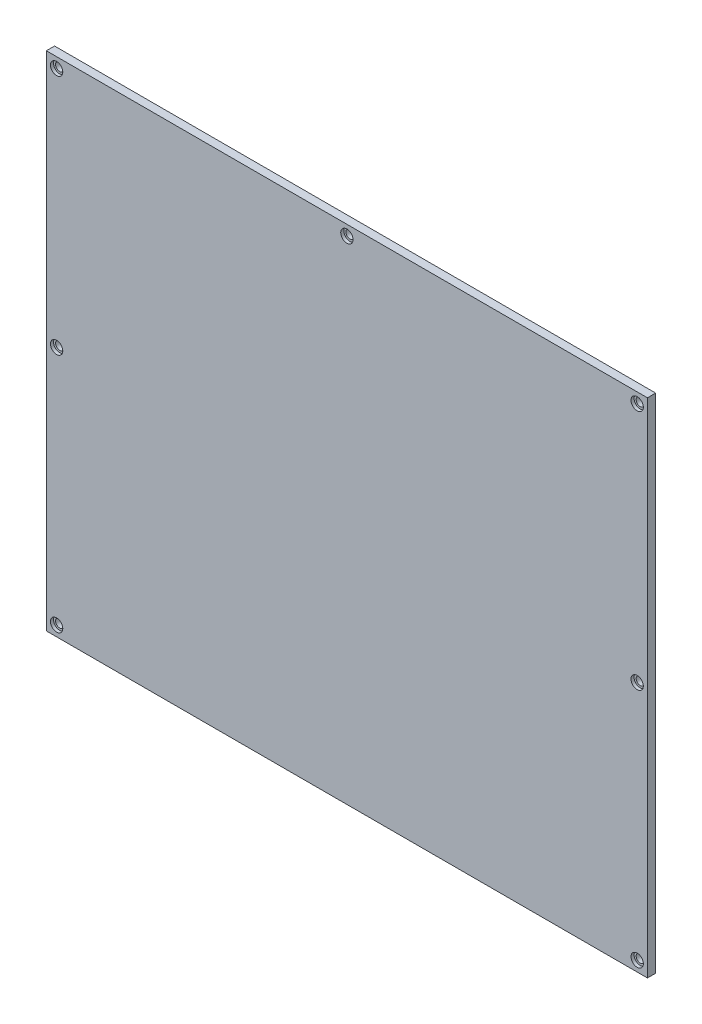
ISO-10303-21;
HEADER;
FILE_DESCRIPTION(('STEP AP214'),'2;1');
FILE_NAME('part.step','',(''),(''),'','','');
FILE_SCHEMA(('AUTOMOTIVE_DESIGN { 1 0 10303 214 1 1 1 1 }'));
ENDSEC;
DATA;
#1=APPLICATION_CONTEXT('core data for automotive mechanical design processes');
#2=APPLICATION_PROTOCOL_DEFINITION('international standard','automotive_design',2000,#1);
#3=PRODUCT_CONTEXT('',#1,'mechanical');
#4=PRODUCT('Part','Part','',(#3));
#5=PRODUCT_RELATED_PRODUCT_CATEGORY('part','',(#4));
#6=PRODUCT_DEFINITION_FORMATION('','',#4);
#7=PRODUCT_DEFINITION_CONTEXT('part definition',#1,'design');
#8=PRODUCT_DEFINITION('design','',#6,#7);
#9=PRODUCT_DEFINITION_SHAPE('','',#8);
#10=(LENGTH_UNIT() NAMED_UNIT(*) SI_UNIT(.MILLI.,.METRE.));
#11=(NAMED_UNIT(*) PLANE_ANGLE_UNIT() SI_UNIT($,.RADIAN.));
#12=(NAMED_UNIT(*) SI_UNIT($,.STERADIAN.) SOLID_ANGLE_UNIT());
#13=UNCERTAINTY_MEASURE_WITH_UNIT(LENGTH_MEASURE(1.E-05),#10,'distance_accuracy_value','');
#14=(GEOMETRIC_REPRESENTATION_CONTEXT(3) GLOBAL_UNCERTAINTY_ASSIGNED_CONTEXT((#13)) GLOBAL_UNIT_ASSIGNED_CONTEXT((#10,
#11,#12)) REPRESENTATION_CONTEXT('',''));
#15=CARTESIAN_POINT('',(0.,0.,0.));
#16=DIRECTION('',(0.,0.,1.));
#17=DIRECTION('',(1.,0.,0.));
#18=AXIS2_PLACEMENT_3D('',#15,#16,#17);
#19=CARTESIAN_POINT('',(10.,479.,0.));
#20=DIRECTION('',(0.,0.,1.));
#21=DIRECTION('',(1.,0.,0.));
#22=AXIS2_PLACEMENT_3D('',#19,#20,#21);
#23=CYLINDRICAL_SURFACE('',#22,4.);
#24=CARTESIAN_POINT('',(10.,479.,0.));
#25=DIRECTION('',(0.,0.,1.));
#26=DIRECTION('',(1.,0.,0.));
#27=AXIS2_PLACEMENT_3D('',#24,#25,#26);
#28=CIRCLE('',#27,4.);
#29=CARTESIAN_POINT('',(14.,479.,0.));
#30=VERTEX_POINT('',#29);
#31=EDGE_CURVE('E119',#30,#30,#28,.T.);
#32=ORIENTED_EDGE('',*,*,#31,.F.);
#33=EDGE_LOOP('',(#32));
#34=FACE_BOUND('',#33,.T.);
#35=CARTESIAN_POINT('',(10.,479.,5.));
#36=DIRECTION('',(0.,0.,1.));
#37=DIRECTION('',(1.,0.,0.));
#38=AXIS2_PLACEMENT_3D('',#35,#36,#37);
#39=CIRCLE('',#38,4.);
#40=CARTESIAN_POINT('',(14.,479.,5.));
#41=VERTEX_POINT('',#40);
#42=EDGE_CURVE('E47',#41,#41,#39,.F.);
#43=ORIENTED_EDGE('',*,*,#42,.F.);
#44=EDGE_LOOP('',(#43));
#45=FACE_BOUND('',#44,.T.);
#46=ADVANCED_FACE('F43',(#34,#45),#23,.F.);
#47=CARTESIAN_POINT('',(575.,10.,0.));
#48=DIRECTION('',(0.,0.,1.));
#49=DIRECTION('',(1.,0.,0.));
#50=AXIS2_PLACEMENT_3D('',#47,#48,#49);
#51=CYLINDRICAL_SURFACE('',#50,3.99999999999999);
#52=CARTESIAN_POINT('',(575.,10.,0.));
#53=DIRECTION('',(0.,0.,1.));
#54=DIRECTION('',(1.,0.,0.));
#55=AXIS2_PLACEMENT_3D('',#52,#53,#54);
#56=CIRCLE('',#55,3.99999999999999);
#57=CARTESIAN_POINT('',(579.,10.,0.));
#58=VERTEX_POINT('',#57);
#59=EDGE_CURVE('E157',#58,#58,#56,.T.);
#60=ORIENTED_EDGE('',*,*,#59,.F.);
#61=EDGE_LOOP('',(#60));
#62=FACE_BOUND('',#61,.T.);
#63=CARTESIAN_POINT('',(575.,10.,5.));
#64=DIRECTION('',(0.,0.,1.));
#65=DIRECTION('',(1.,0.,0.));
#66=AXIS2_PLACEMENT_3D('',#63,#64,#65);
#67=CIRCLE('',#66,3.99999999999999);
#68=CARTESIAN_POINT('',(579.,10.,5.));
#69=VERTEX_POINT('',#68);
#70=EDGE_CURVE('E150',#69,#69,#67,.F.);
#71=ORIENTED_EDGE('',*,*,#70,.F.);
#72=EDGE_LOOP('',(#71));
#73=FACE_BOUND('',#72,.T.);
#74=ADVANCED_FACE('F197',(#62,#73),#51,.F.);
#75=CARTESIAN_POINT('',(575.,244.,0.));
#76=DIRECTION('',(0.,0.,1.));
#77=DIRECTION('',(1.,0.,0.));
#78=AXIS2_PLACEMENT_3D('',#75,#76,#77);
#79=CYLINDRICAL_SURFACE('',#78,3.99999999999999);
#80=CARTESIAN_POINT('',(575.,244.,0.));
#81=DIRECTION('',(0.,0.,1.));
#82=DIRECTION('',(1.,0.,0.));
#83=AXIS2_PLACEMENT_3D('',#80,#81,#82);
#84=CIRCLE('',#83,3.99999999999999);
#85=CARTESIAN_POINT('',(579.,244.,0.));
#86=VERTEX_POINT('',#85);
#87=EDGE_CURVE('E162',#86,#86,#84,.T.);
#88=ORIENTED_EDGE('',*,*,#87,.F.);
#89=EDGE_LOOP('',(#88));
#90=FACE_BOUND('',#89,.T.);
#91=CARTESIAN_POINT('',(575.,244.,5.));
#92=DIRECTION('',(0.,0.,1.));
#93=DIRECTION('',(1.,0.,0.));
#94=AXIS2_PLACEMENT_3D('',#91,#92,#93);
#95=CIRCLE('',#94,3.99999999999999);
#96=CARTESIAN_POINT('',(579.,244.,5.));
#97=VERTEX_POINT('',#96);
#98=EDGE_CURVE('E147',#97,#97,#95,.F.);
#99=ORIENTED_EDGE('',*,*,#98,.F.);
#100=EDGE_LOOP('',(#99));
#101=FACE_BOUND('',#100,.T.);
#102=ADVANCED_FACE('F203',(#90,#101),#79,.F.);
#103=CARTESIAN_POINT('',(575.,479.,0.));
#104=DIRECTION('',(0.,0.,1.));
#105=DIRECTION('',(1.,0.,0.));
#106=AXIS2_PLACEMENT_3D('',#103,#104,#105);
#107=CYLINDRICAL_SURFACE('',#106,3.99999999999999);
#108=CARTESIAN_POINT('',(575.,479.,0.));
#109=DIRECTION('',(0.,0.,1.));
#110=DIRECTION('',(1.,0.,0.));
#111=AXIS2_PLACEMENT_3D('',#108,#109,#110);
#112=CIRCLE('',#111,3.99999999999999);
#113=CARTESIAN_POINT('',(579.,479.,0.));
#114=VERTEX_POINT('',#113);
#115=EDGE_CURVE('E168',#114,#114,#112,.T.);
#116=ORIENTED_EDGE('',*,*,#115,.F.);
#117=EDGE_LOOP('',(#116));
#118=FACE_BOUND('',#117,.T.);
#119=CARTESIAN_POINT('',(575.,479.,5.));
#120=DIRECTION('',(0.,0.,1.));
#121=DIRECTION('',(1.,0.,0.));
#122=AXIS2_PLACEMENT_3D('',#119,#120,#121);
#123=CIRCLE('',#122,3.99999999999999);
#124=CARTESIAN_POINT('',(579.,479.,5.));
#125=VERTEX_POINT('',#124);
#126=EDGE_CURVE('E143',#125,#125,#123,.F.);
#127=ORIENTED_EDGE('',*,*,#126,.F.);
#128=EDGE_LOOP('',(#127));
#129=FACE_BOUND('',#128,.T.);
#130=ADVANCED_FACE('F208',(#118,#129),#107,.F.);
#131=CARTESIAN_POINT('',(292.5,479.,0.));
#132=DIRECTION('',(0.,0.,1.));
#133=DIRECTION('',(1.,0.,0.));
#134=AXIS2_PLACEMENT_3D('',#131,#132,#133);
#135=CYLINDRICAL_SURFACE('',#134,3.99999999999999);
#136=CARTESIAN_POINT('',(292.5,479.,0.));
#137=DIRECTION('',(0.,0.,1.));
#138=DIRECTION('',(1.,0.,0.));
#139=AXIS2_PLACEMENT_3D('',#136,#137,#138);
#140=CIRCLE('',#139,3.99999999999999);
#141=CARTESIAN_POINT('',(296.5,479.,0.));
#142=VERTEX_POINT('',#141);
#143=EDGE_CURVE('E180',#142,#142,#140,.T.);
#144=ORIENTED_EDGE('',*,*,#143,.F.);
#145=EDGE_LOOP('',(#144));
#146=FACE_BOUND('',#145,.T.);
#147=CARTESIAN_POINT('',(292.5,479.,5.));
#148=DIRECTION('',(0.,0.,1.));
#149=DIRECTION('',(1.,0.,0.));
#150=AXIS2_PLACEMENT_3D('',#147,#148,#149);
#151=CIRCLE('',#150,3.99999999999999);
#152=CARTESIAN_POINT('',(296.5,479.,5.));
#153=VERTEX_POINT('',#152);
#154=EDGE_CURVE('E139',#153,#153,#151,.F.);
#155=ORIENTED_EDGE('',*,*,#154,.F.);
#156=EDGE_LOOP('',(#155));
#157=FACE_BOUND('',#156,.T.);
#158=ADVANCED_FACE('F237',(#146,#157),#135,.F.);
#159=CARTESIAN_POINT('',(10.,244.,0.));
#160=DIRECTION('',(0.,0.,1.));
#161=DIRECTION('',(1.,0.,0.));
#162=AXIS2_PLACEMENT_3D('',#159,#160,#161);
#163=CYLINDRICAL_SURFACE('',#162,4.);
#164=CARTESIAN_POINT('',(10.,244.,0.));
#165=DIRECTION('',(0.,0.,1.));
#166=DIRECTION('',(1.,0.,0.));
#167=AXIS2_PLACEMENT_3D('',#164,#165,#166);
#168=CIRCLE('',#167,4.);
#169=CARTESIAN_POINT('',(14.,244.,0.));
#170=VERTEX_POINT('',#169);
#171=EDGE_CURVE('E176',#170,#170,#168,.T.);
#172=ORIENTED_EDGE('',*,*,#171,.F.);
#173=EDGE_LOOP('',(#172));
#174=FACE_BOUND('',#173,.T.);
#175=CARTESIAN_POINT('',(10.,244.,5.));
#176=DIRECTION('',(0.,0.,1.));
#177=DIRECTION('',(1.,0.,0.));
#178=AXIS2_PLACEMENT_3D('',#175,#176,#177);
#179=CIRCLE('',#178,4.);
#180=CARTESIAN_POINT('',(14.,244.,5.));
#181=VERTEX_POINT('',#180);
#182=EDGE_CURVE('E134',#181,#181,#179,.F.);
#183=ORIENTED_EDGE('',*,*,#182,.F.);
#184=EDGE_LOOP('',(#183));
#185=FACE_BOUND('',#184,.T.);
#186=ADVANCED_FACE('F230',(#174,#185),#163,.F.);
#187=CARTESIAN_POINT('',(10.,10.,0.));
#188=DIRECTION('',(0.,0.,1.));
#189=DIRECTION('',(1.,0.,0.));
#190=AXIS2_PLACEMENT_3D('',#187,#188,#189);
#191=CYLINDRICAL_SURFACE('',#190,4.);
#192=CARTESIAN_POINT('',(10.,10.,0.));
#193=DIRECTION('',(0.,0.,1.));
#194=DIRECTION('',(1.,0.,0.));
#195=AXIS2_PLACEMENT_3D('',#192,#193,#194);
#196=CIRCLE('',#195,4.);
#197=CARTESIAN_POINT('',(14.,10.,0.));
#198=VERTEX_POINT('',#197);
#199=EDGE_CURVE('E172',#198,#198,#196,.T.);
#200=ORIENTED_EDGE('',*,*,#199,.F.);
#201=EDGE_LOOP('',(#200));
#202=FACE_BOUND('',#201,.T.);
#203=CARTESIAN_POINT('',(10.,10.,5.));
#204=DIRECTION('',(0.,0.,1.));
#205=DIRECTION('',(1.,0.,0.));
#206=AXIS2_PLACEMENT_3D('',#203,#204,#205);
#207=CIRCLE('',#206,4.);
#208=CARTESIAN_POINT('',(14.,10.,5.));
#209=VERTEX_POINT('',#208);
#210=EDGE_CURVE('E130',#209,#209,#207,.F.);
#211=ORIENTED_EDGE('',*,*,#210,.F.);
#212=EDGE_LOOP('',(#211));
#213=FACE_BOUND('',#212,.T.);
#214=ADVANCED_FACE('F225',(#202,#213),#191,.F.);
#215=CARTESIAN_POINT('',(0.,0.,8.));
#216=DIRECTION('',(1.,0.,0.));
#217=DIRECTION('',(0.,0.,-1.));
#218=AXIS2_PLACEMENT_3D('',#215,#216,#217);
#219=PLANE('',#218);
#220=DIRECTION('',(0.,-1.,0.));
#221=VECTOR('',#220,1.);
#222=CARTESIAN_POINT('',(0.,0.,0.));
#223=LINE('',#222,#221);
#224=CARTESIAN_POINT('',(0.,489.,0.));
#225=VERTEX_POINT('',#224);
#226=CARTESIAN_POINT('',(0.,0.,0.));
#227=VERTEX_POINT('',#226);
#228=EDGE_CURVE('E115',#225,#227,#223,.T.);
#229=ORIENTED_EDGE('',*,*,#228,.T.);
#230=DIRECTION('',(0.,0.,-1.));
#231=VECTOR('',#230,1.);
#232=CARTESIAN_POINT('',(0.,0.,8.));
#233=LINE('',#232,#231);
#234=CARTESIAN_POINT('',(0.,0.,8.));
#235=VERTEX_POINT('',#234);
#236=EDGE_CURVE('E11',#235,#227,#233,.T.);
#237=ORIENTED_EDGE('',*,*,#236,.F.);
#238=DIRECTION('',(0.,-1.,0.));
#239=VECTOR('',#238,1.);
#240=CARTESIAN_POINT('',(0.,0.,8.));
#241=LINE('',#240,#239);
#242=CARTESIAN_POINT('',(0.,489.,8.));
#243=VERTEX_POINT('',#242);
#244=EDGE_CURVE('E98',#243,#235,#241,.T.);
#245=ORIENTED_EDGE('',*,*,#244,.F.);
#246=DIRECTION('',(0.,0.,-1.));
#247=VECTOR('',#246,1.);
#248=CARTESIAN_POINT('',(0.,489.,8.));
#249=LINE('',#248,#247);
#250=EDGE_CURVE('E111',#243,#225,#249,.T.);
#251=ORIENTED_EDGE('',*,*,#250,.T.);
#252=EDGE_LOOP('',(#229,#237,#245,#251));
#253=FACE_BOUND('',#252,.T.);
#254=ADVANCED_FACE('F45',(#253),#219,.F.);
#255=CARTESIAN_POINT('',(0.,0.,8.));
#256=DIRECTION('',(0.,1.,0.));
#257=DIRECTION('',(0.,0.,1.));
#258=AXIS2_PLACEMENT_3D('',#255,#256,#257);
#259=PLANE('',#258);
#260=DIRECTION('',(1.,0.,0.));
#261=VECTOR('',#260,1.);
#262=CARTESIAN_POINT('',(0.,0.,0.));
#263=LINE('',#262,#261);
#264=CARTESIAN_POINT('',(585.,0.,0.));
#265=VERTEX_POINT('',#264);
#266=EDGE_CURVE('E103',#227,#265,#263,.T.);
#267=ORIENTED_EDGE('',*,*,#266,.T.);
#268=DIRECTION('',(0.,0.,-1.));
#269=VECTOR('',#268,1.);
#270=CARTESIAN_POINT('',(585.,0.,8.));
#271=LINE('',#270,#269);
#272=CARTESIAN_POINT('',(585.,0.,8.));
#273=VERTEX_POINT('',#272);
#274=EDGE_CURVE('E54',#273,#265,#271,.T.);
#275=ORIENTED_EDGE('',*,*,#274,.F.);
#276=DIRECTION('',(1.,0.,0.));
#277=VECTOR('',#276,1.);
#278=CARTESIAN_POINT('',(0.,0.,8.));
#279=LINE('',#278,#277);
#280=EDGE_CURVE('E93',#235,#273,#279,.T.);
#281=ORIENTED_EDGE('',*,*,#280,.F.);
#282=ORIENTED_EDGE('',*,*,#236,.T.);
#283=EDGE_LOOP('',(#267,#275,#281,#282));
#284=FACE_BOUND('',#283,.T.);
#285=ADVANCED_FACE('F102',(#284),#259,.F.);
#286=CARTESIAN_POINT('',(585.,0.,8.));
#287=DIRECTION('',(-1.,0.,0.));
#288=DIRECTION('',(0.,0.,1.));
#289=AXIS2_PLACEMENT_3D('',#286,#287,#288);
#290=PLANE('',#289);
#291=DIRECTION('',(0.,1.,0.));
#292=VECTOR('',#291,1.);
#293=CARTESIAN_POINT('',(585.,0.,0.));
#294=LINE('',#293,#292);
#295=CARTESIAN_POINT('',(585.,489.,0.));
#296=VERTEX_POINT('',#295);
#297=EDGE_CURVE('E80',#265,#296,#294,.T.);
#298=ORIENTED_EDGE('',*,*,#297,.T.);
#299=DIRECTION('',(0.,0.,-1.));
#300=VECTOR('',#299,1.);
#301=CARTESIAN_POINT('',(585.,489.,8.));
#302=LINE('',#301,#300);
#303=CARTESIAN_POINT('',(585.,489.,8.));
#304=VERTEX_POINT('',#303);
#305=EDGE_CURVE('E105',#304,#296,#302,.T.);
#306=ORIENTED_EDGE('',*,*,#305,.F.);
#307=DIRECTION('',(0.,1.,0.));
#308=VECTOR('',#307,1.);
#309=CARTESIAN_POINT('',(585.,0.,8.));
#310=LINE('',#309,#308);
#311=EDGE_CURVE('E96',#273,#304,#310,.T.);
#312=ORIENTED_EDGE('',*,*,#311,.F.);
#313=ORIENTED_EDGE('',*,*,#274,.T.);
#314=EDGE_LOOP('',(#298,#306,#312,#313));
#315=FACE_BOUND('',#314,.T.);
#316=ADVANCED_FACE('F107',(#315),#290,.F.);
#317=CARTESIAN_POINT('',(0.,489.,8.));
#318=DIRECTION('',(0.,-1.,0.));
#319=DIRECTION('',(0.,0.,-1.));
#320=AXIS2_PLACEMENT_3D('',#317,#318,#319);
#321=PLANE('',#320);
#322=DIRECTION('',(-1.,0.,0.));
#323=VECTOR('',#322,1.);
#324=CARTESIAN_POINT('',(0.,489.,0.));
#325=LINE('',#324,#323);
#326=EDGE_CURVE('E86',#296,#225,#325,.T.);
#327=ORIENTED_EDGE('',*,*,#326,.T.);
#328=ORIENTED_EDGE('',*,*,#250,.F.);
#329=DIRECTION('',(-1.,0.,0.));
#330=VECTOR('',#329,1.);
#331=CARTESIAN_POINT('',(0.,489.,8.));
#332=LINE('',#331,#330);
#333=EDGE_CURVE('E63',#304,#243,#332,.T.);
#334=ORIENTED_EDGE('',*,*,#333,.F.);
#335=ORIENTED_EDGE('',*,*,#305,.T.);
#336=EDGE_LOOP('',(#327,#328,#334,#335));
#337=FACE_BOUND('',#336,.T.);
#338=ADVANCED_FACE('F212',(#337),#321,.F.);
#339=CARTESIAN_POINT('',(0.,0.,8.));
#340=DIRECTION('',(0.,0.,-1.));
#341=DIRECTION('',(-1.,0.,0.));
#342=AXIS2_PLACEMENT_3D('',#339,#340,#341);
#343=PLANE('',#342);
#344=CARTESIAN_POINT('',(575.,10.,8.));
#345=DIRECTION('',(0.,0.,1.));
#346=DIRECTION('',(1.,0.,0.));
#347=AXIS2_PLACEMENT_3D('',#344,#345,#346);
#348=CIRCLE('',#347,5.99999999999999);
#349=CARTESIAN_POINT('',(581.,10.,8.));
#350=VERTEX_POINT('',#349);
#351=EDGE_CURVE('E508',#350,#350,#348,.T.);
#352=ORIENTED_EDGE('',*,*,#351,.F.);
#353=EDGE_LOOP('',(#352));
#354=FACE_BOUND('',#353,.T.);
#355=CARTESIAN_POINT('',(10.,10.,8.));
#356=DIRECTION('',(0.,0.,1.));
#357=DIRECTION('',(1.,0.,0.));
#358=AXIS2_PLACEMENT_3D('',#355,#356,#357);
#359=CIRCLE('',#358,6.);
#360=CARTESIAN_POINT('',(16.,10.,8.));
#361=VERTEX_POINT('',#360);
#362=EDGE_CURVE('E500',#361,#361,#359,.T.);
#363=ORIENTED_EDGE('',*,*,#362,.F.);
#364=EDGE_LOOP('',(#363));
#365=FACE_BOUND('',#364,.T.);
#366=CARTESIAN_POINT('',(292.5,479.,8.));
#367=DIRECTION('',(0.,0.,1.));
#368=DIRECTION('',(1.,0.,0.));
#369=AXIS2_PLACEMENT_3D('',#366,#367,#368);
#370=CIRCLE('',#369,5.99999999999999);
#371=CARTESIAN_POINT('',(298.5,479.,8.));
#372=VERTEX_POINT('',#371);
#373=EDGE_CURVE('E486',#372,#372,#370,.T.);
#374=ORIENTED_EDGE('',*,*,#373,.F.);
#375=EDGE_LOOP('',(#374));
#376=FACE_BOUND('',#375,.T.);
#377=CARTESIAN_POINT('',(575.,244.,8.));
#378=DIRECTION('',(0.,0.,1.));
#379=DIRECTION('',(1.,0.,0.));
#380=AXIS2_PLACEMENT_3D('',#377,#378,#379);
#381=CIRCLE('',#380,5.99999999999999);
#382=CARTESIAN_POINT('',(581.,244.,8.));
#383=VERTEX_POINT('',#382);
#384=EDGE_CURVE('E472',#383,#383,#381,.T.);
#385=ORIENTED_EDGE('',*,*,#384,.F.);
#386=EDGE_LOOP('',(#385));
#387=FACE_BOUND('',#386,.T.);
#388=CARTESIAN_POINT('',(575.,479.,8.));
#389=DIRECTION('',(0.,0.,1.));
#390=DIRECTION('',(1.,0.,0.));
#391=AXIS2_PLACEMENT_3D('',#388,#389,#390);
#392=CIRCLE('',#391,5.99999999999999);
#393=CARTESIAN_POINT('',(581.,479.,8.));
#394=VERTEX_POINT('',#393);
#395=EDGE_CURVE('E465',#394,#394,#392,.T.);
#396=ORIENTED_EDGE('',*,*,#395,.F.);
#397=EDGE_LOOP('',(#396));
#398=FACE_BOUND('',#397,.T.);
#399=CARTESIAN_POINT('',(10.,244.,8.));
#400=DIRECTION('',(0.,0.,1.));
#401=DIRECTION('',(1.,0.,0.));
#402=AXIS2_PLACEMENT_3D('',#399,#400,#401);
#403=CIRCLE('',#402,6.);
#404=CARTESIAN_POINT('',(16.,244.,8.));
#405=VERTEX_POINT('',#404);
#406=EDGE_CURVE('E475',#405,#405,#403,.T.);
#407=ORIENTED_EDGE('',*,*,#406,.F.);
#408=EDGE_LOOP('',(#407));
#409=FACE_BOUND('',#408,.T.);
#410=CARTESIAN_POINT('',(10.,479.,8.));
#411=DIRECTION('',(0.,0.,1.));
#412=DIRECTION('',(1.,0.,0.));
#413=AXIS2_PLACEMENT_3D('',#410,#411,#412);
#414=CIRCLE('',#413,6.);
#415=CARTESIAN_POINT('',(16.,479.,8.));
#416=VERTEX_POINT('',#415);
#417=EDGE_CURVE('E485',#416,#416,#414,.T.);
#418=ORIENTED_EDGE('',*,*,#417,.F.);
#419=EDGE_LOOP('',(#418));
#420=FACE_BOUND('',#419,.T.);
#421=ORIENTED_EDGE('',*,*,#244,.T.);
#422=ORIENTED_EDGE('',*,*,#280,.T.);
#423=ORIENTED_EDGE('',*,*,#311,.T.);
#424=ORIENTED_EDGE('',*,*,#333,.T.);
#425=EDGE_LOOP('',(#421,#422,#423,#424));
#426=FACE_BOUND('',#425,.T.);
#427=ADVANCED_FACE('F94',(#354,#365,#376,#387,#398,#409,#420,#426),#343,.F.);
#428=CARTESIAN_POINT('',(0.,0.,0.));
#429=DIRECTION('',(0.,0.,-1.));
#430=DIRECTION('',(-1.,0.,0.));
#431=AXIS2_PLACEMENT_3D('',#428,#429,#430);
#432=PLANE('',#431);
#433=ORIENTED_EDGE('',*,*,#199,.T.);
#434=EDGE_LOOP('',(#433));
#435=FACE_BOUND('',#434,.T.);
#436=ORIENTED_EDGE('',*,*,#171,.T.);
#437=EDGE_LOOP('',(#436));
#438=FACE_BOUND('',#437,.T.);
#439=ORIENTED_EDGE('',*,*,#143,.T.);
#440=EDGE_LOOP('',(#439));
#441=FACE_BOUND('',#440,.T.);
#442=ORIENTED_EDGE('',*,*,#115,.T.);
#443=EDGE_LOOP('',(#442));
#444=FACE_BOUND('',#443,.T.);
#445=ORIENTED_EDGE('',*,*,#87,.T.);
#446=EDGE_LOOP('',(#445));
#447=FACE_BOUND('',#446,.T.);
#448=ORIENTED_EDGE('',*,*,#59,.T.);
#449=EDGE_LOOP('',(#448));
#450=FACE_BOUND('',#449,.T.);
#451=ORIENTED_EDGE('',*,*,#31,.T.);
#452=EDGE_LOOP('',(#451));
#453=FACE_BOUND('',#452,.T.);
#454=ORIENTED_EDGE('',*,*,#228,.F.);
#455=ORIENTED_EDGE('',*,*,#326,.F.);
#456=ORIENTED_EDGE('',*,*,#297,.F.);
#457=ORIENTED_EDGE('',*,*,#266,.F.);
#458=EDGE_LOOP('',(#454,#455,#456,#457));
#459=FACE_BOUND('',#458,.T.);
#460=ADVANCED_FACE('F192',(#435,#438,#441,#444,#447,#450,#453,#459),#432,.T.);
#461=CARTESIAN_POINT('',(10.,10.,5.));
#462=DIRECTION('',(0.,0.,1.));
#463=DIRECTION('',(1.,0.,0.));
#464=AXIS2_PLACEMENT_3D('',#461,#462,#463);
#465=PLANE('',#464);
#466=CARTESIAN_POINT('',(10.,10.,5.));
#467=DIRECTION('',(0.,0.,1.));
#468=DIRECTION('',(1.,0.,0.));
#469=AXIS2_PLACEMENT_3D('',#466,#467,#468);
#470=CIRCLE('',#469,6.);
#471=CARTESIAN_POINT('',(16.,10.,5.));
#472=VERTEX_POINT('',#471);
#473=EDGE_CURVE('E481',#472,#472,#470,.T.);
#474=ORIENTED_EDGE('',*,*,#473,.T.);
#475=EDGE_LOOP('',(#474));
#476=FACE_BOUND('',#475,.T.);
#477=ORIENTED_EDGE('',*,*,#210,.T.);
#478=EDGE_LOOP('',(#477));
#479=FACE_BOUND('',#478,.T.);
#480=ADVANCED_FACE('F216',(#476,#479),#465,.T.);
#481=CARTESIAN_POINT('',(10.,10.,5.));
#482=DIRECTION('',(0.,0.,1.));
#483=DIRECTION('',(1.,0.,0.));
#484=AXIS2_PLACEMENT_3D('',#481,#482,#483);
#485=CYLINDRICAL_SURFACE('',#484,6.);
#486=ORIENTED_EDGE('',*,*,#473,.F.);
#487=EDGE_LOOP('',(#486));
#488=FACE_BOUND('',#487,.T.);
#489=ORIENTED_EDGE('',*,*,#362,.T.);
#490=EDGE_LOOP('',(#489));
#491=FACE_BOUND('',#490,.T.);
#492=ADVANCED_FACE('F284',(#488,#491),#485,.F.);
#493=CARTESIAN_POINT('',(10.,244.,5.));
#494=DIRECTION('',(0.,0.,1.));
#495=DIRECTION('',(1.,0.,0.));
#496=AXIS2_PLACEMENT_3D('',#493,#494,#495);
#497=PLANE('',#496);
#498=CARTESIAN_POINT('',(10.,244.,5.));
#499=DIRECTION('',(0.,0.,1.));
#500=DIRECTION('',(1.,0.,0.));
#501=AXIS2_PLACEMENT_3D('',#498,#499,#500);
#502=CIRCLE('',#501,6.);
#503=CARTESIAN_POINT('',(16.,244.,5.));
#504=VERTEX_POINT('',#503);
#505=EDGE_CURVE('E468',#504,#504,#502,.T.);
#506=ORIENTED_EDGE('',*,*,#505,.T.);
#507=EDGE_LOOP('',(#506));
#508=FACE_BOUND('',#507,.T.);
#509=ORIENTED_EDGE('',*,*,#182,.T.);
#510=EDGE_LOOP('',(#509));
#511=FACE_BOUND('',#510,.T.);
#512=ADVANCED_FACE('F266',(#508,#511),#497,.T.);
#513=CARTESIAN_POINT('',(10.,244.,5.));
#514=DIRECTION('',(0.,0.,1.));
#515=DIRECTION('',(1.,0.,0.));
#516=AXIS2_PLACEMENT_3D('',#513,#514,#515);
#517=CYLINDRICAL_SURFACE('',#516,6.);
#518=ORIENTED_EDGE('',*,*,#505,.F.);
#519=EDGE_LOOP('',(#518));
#520=FACE_BOUND('',#519,.T.);
#521=ORIENTED_EDGE('',*,*,#406,.T.);
#522=EDGE_LOOP('',(#521));
#523=FACE_BOUND('',#522,.T.);
#524=ADVANCED_FACE('F256',(#520,#523),#517,.F.);
#525=CARTESIAN_POINT('',(292.5,479.,5.));
#526=DIRECTION('',(0.,0.,1.));
#527=DIRECTION('',(1.,0.,0.));
#528=AXIS2_PLACEMENT_3D('',#525,#526,#527);
#529=PLANE('',#528);
#530=CARTESIAN_POINT('',(292.5,479.,5.));
#531=DIRECTION('',(0.,0.,1.));
#532=DIRECTION('',(1.,0.,0.));
#533=AXIS2_PLACEMENT_3D('',#530,#531,#532);
#534=CIRCLE('',#533,5.99999999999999);
#535=CARTESIAN_POINT('',(298.5,479.,5.));
#536=VERTEX_POINT('',#535);
#537=EDGE_CURVE('E482',#536,#536,#534,.T.);
#538=ORIENTED_EDGE('',*,*,#537,.T.);
#539=EDGE_LOOP('',(#538));
#540=FACE_BOUND('',#539,.T.);
#541=ORIENTED_EDGE('',*,*,#154,.T.);
#542=EDGE_LOOP('',(#541));
#543=FACE_BOUND('',#542,.T.);
#544=ADVANCED_FACE('F253',(#540,#543),#529,.T.);
#545=CARTESIAN_POINT('',(292.5,479.,5.));
#546=DIRECTION('',(0.,0.,1.));
#547=DIRECTION('',(1.,0.,0.));
#548=AXIS2_PLACEMENT_3D('',#545,#546,#547);
#549=CYLINDRICAL_SURFACE('',#548,5.99999999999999);
#550=ORIENTED_EDGE('',*,*,#537,.F.);
#551=EDGE_LOOP('',(#550));
#552=FACE_BOUND('',#551,.T.);
#553=ORIENTED_EDGE('',*,*,#373,.T.);
#554=EDGE_LOOP('',(#553));
#555=FACE_BOUND('',#554,.T.);
#556=ADVANCED_FACE('F255',(#552,#555),#549,.F.);
#557=CARTESIAN_POINT('',(575.,479.,5.));
#558=DIRECTION('',(0.,0.,1.));
#559=DIRECTION('',(1.,0.,0.));
#560=AXIS2_PLACEMENT_3D('',#557,#558,#559);
#561=PLANE('',#560);
#562=CARTESIAN_POINT('',(575.,479.,5.));
#563=DIRECTION('',(0.,0.,1.));
#564=DIRECTION('',(1.,0.,0.));
#565=AXIS2_PLACEMENT_3D('',#562,#563,#564);
#566=CIRCLE('',#565,5.99999999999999);
#567=CARTESIAN_POINT('',(581.,479.,5.));
#568=VERTEX_POINT('',#567);
#569=EDGE_CURVE('E462',#568,#568,#566,.T.);
#570=ORIENTED_EDGE('',*,*,#569,.T.);
#571=EDGE_LOOP('',(#570));
#572=FACE_BOUND('',#571,.T.);
#573=ORIENTED_EDGE('',*,*,#126,.T.);
#574=EDGE_LOOP('',(#573));
#575=FACE_BOUND('',#574,.T.);
#576=ADVANCED_FACE('F263',(#572,#575),#561,.T.);
#577=CARTESIAN_POINT('',(575.,479.,5.));
#578=DIRECTION('',(0.,0.,1.));
#579=DIRECTION('',(1.,0.,0.));
#580=AXIS2_PLACEMENT_3D('',#577,#578,#579);
#581=CYLINDRICAL_SURFACE('',#580,5.99999999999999);
#582=ORIENTED_EDGE('',*,*,#569,.F.);
#583=EDGE_LOOP('',(#582));
#584=FACE_BOUND('',#583,.T.);
#585=ORIENTED_EDGE('',*,*,#395,.T.);
#586=EDGE_LOOP('',(#585));
#587=FACE_BOUND('',#586,.T.);
#588=ADVANCED_FACE('F276',(#584,#587),#581,.F.);
#589=CARTESIAN_POINT('',(575.,244.,5.));
#590=DIRECTION('',(0.,0.,1.));
#591=DIRECTION('',(1.,0.,0.));
#592=AXIS2_PLACEMENT_3D('',#589,#590,#591);
#593=PLANE('',#592);
#594=CARTESIAN_POINT('',(575.,244.,5.));
#595=DIRECTION('',(0.,0.,1.));
#596=DIRECTION('',(1.,0.,0.));
#597=AXIS2_PLACEMENT_3D('',#594,#595,#596);
#598=CIRCLE('',#597,5.99999999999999);
#599=CARTESIAN_POINT('',(581.,244.,5.));
#600=VERTEX_POINT('',#599);
#601=EDGE_CURVE('E490',#600,#600,#598,.T.);
#602=ORIENTED_EDGE('',*,*,#601,.T.);
#603=EDGE_LOOP('',(#602));
#604=FACE_BOUND('',#603,.T.);
#605=ORIENTED_EDGE('',*,*,#98,.T.);
#606=EDGE_LOOP('',(#605));
#607=FACE_BOUND('',#606,.T.);
#608=ADVANCED_FACE('F272',(#604,#607),#593,.T.);
#609=CARTESIAN_POINT('',(575.,244.,5.));
#610=DIRECTION('',(0.,0.,1.));
#611=DIRECTION('',(1.,0.,0.));
#612=AXIS2_PLACEMENT_3D('',#609,#610,#611);
#613=CYLINDRICAL_SURFACE('',#612,5.99999999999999);
#614=ORIENTED_EDGE('',*,*,#601,.F.);
#615=EDGE_LOOP('',(#614));
#616=FACE_BOUND('',#615,.T.);
#617=ORIENTED_EDGE('',*,*,#384,.T.);
#618=EDGE_LOOP('',(#617));
#619=FACE_BOUND('',#618,.T.);
#620=ADVANCED_FACE('F275',(#616,#619),#613,.F.);
#621=CARTESIAN_POINT('',(575.,10.,5.));
#622=DIRECTION('',(0.,0.,1.));
#623=DIRECTION('',(1.,0.,0.));
#624=AXIS2_PLACEMENT_3D('',#621,#622,#623);
#625=PLANE('',#624);
#626=CARTESIAN_POINT('',(575.,10.,5.));
#627=DIRECTION('',(0.,0.,1.));
#628=DIRECTION('',(1.,0.,0.));
#629=AXIS2_PLACEMENT_3D('',#626,#627,#628);
#630=CIRCLE('',#629,5.99999999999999);
#631=CARTESIAN_POINT('',(581.,10.,5.));
#632=VERTEX_POINT('',#631);
#633=EDGE_CURVE('E504',#632,#632,#630,.T.);
#634=ORIENTED_EDGE('',*,*,#633,.T.);
#635=EDGE_LOOP('',(#634));
#636=FACE_BOUND('',#635,.T.);
#637=ORIENTED_EDGE('',*,*,#70,.T.);
#638=EDGE_LOOP('',(#637));
#639=FACE_BOUND('',#638,.T.);
#640=ADVANCED_FACE('F280',(#636,#639),#625,.T.);
#641=CARTESIAN_POINT('',(575.,10.,5.));
#642=DIRECTION('',(0.,0.,1.));
#643=DIRECTION('',(1.,0.,0.));
#644=AXIS2_PLACEMENT_3D('',#641,#642,#643);
#645=CYLINDRICAL_SURFACE('',#644,5.99999999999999);
#646=ORIENTED_EDGE('',*,*,#633,.F.);
#647=EDGE_LOOP('',(#646));
#648=FACE_BOUND('',#647,.T.);
#649=ORIENTED_EDGE('',*,*,#351,.T.);
#650=EDGE_LOOP('',(#649));
#651=FACE_BOUND('',#650,.T.);
#652=ADVANCED_FACE('F291',(#648,#651),#645,.F.);
#653=CARTESIAN_POINT('',(10.,479.,5.));
#654=DIRECTION('',(0.,0.,1.));
#655=DIRECTION('',(1.,0.,0.));
#656=AXIS2_PLACEMENT_3D('',#653,#654,#655);
#657=PLANE('',#656);
#658=CARTESIAN_POINT('',(10.,479.,5.));
#659=DIRECTION('',(0.,0.,1.));
#660=DIRECTION('',(1.,0.,0.));
#661=AXIS2_PLACEMENT_3D('',#658,#659,#660);
#662=CIRCLE('',#661,6.);
#663=CARTESIAN_POINT('',(16.,479.,5.));
#664=VERTEX_POINT('',#663);
#665=EDGE_CURVE('E135',#664,#664,#662,.T.);
#666=ORIENTED_EDGE('',*,*,#665,.T.);
#667=EDGE_LOOP('',(#666));
#668=FACE_BOUND('',#667,.T.);
#669=ORIENTED_EDGE('',*,*,#42,.T.);
#670=EDGE_LOOP('',(#669));
#671=FACE_BOUND('',#670,.T.);
#672=ADVANCED_FACE('F295',(#668,#671),#657,.T.);
#673=CARTESIAN_POINT('',(10.,479.,5.));
#674=DIRECTION('',(0.,0.,1.));
#675=DIRECTION('',(1.,0.,0.));
#676=AXIS2_PLACEMENT_3D('',#673,#674,#675);
#677=CYLINDRICAL_SURFACE('',#676,6.);
#678=ORIENTED_EDGE('',*,*,#665,.F.);
#679=EDGE_LOOP('',(#678));
#680=FACE_BOUND('',#679,.T.);
#681=ORIENTED_EDGE('',*,*,#417,.T.);
#682=EDGE_LOOP('',(#681));
#683=FACE_BOUND('',#682,.T.);
#684=ADVANCED_FACE('F299',(#680,#683),#677,.F.);
#685=CLOSED_SHELL('',(#46,#74,#102,#130,#158,#186,#214,#254,#285,#316,#338,#427,#460,#480,#492,
#512,#524,#544,#556,#576,#588,#608,#620,#640,#652,#672,#684));
#686=MANIFOLD_SOLID_BREP('B2',#685);
#687=ADVANCED_BREP_SHAPE_REPRESENTATION('',(#18,#686),#14);
#688=SHAPE_DEFINITION_REPRESENTATION(#9,#687);
ENDSEC;
END-ISO-10303-21;
